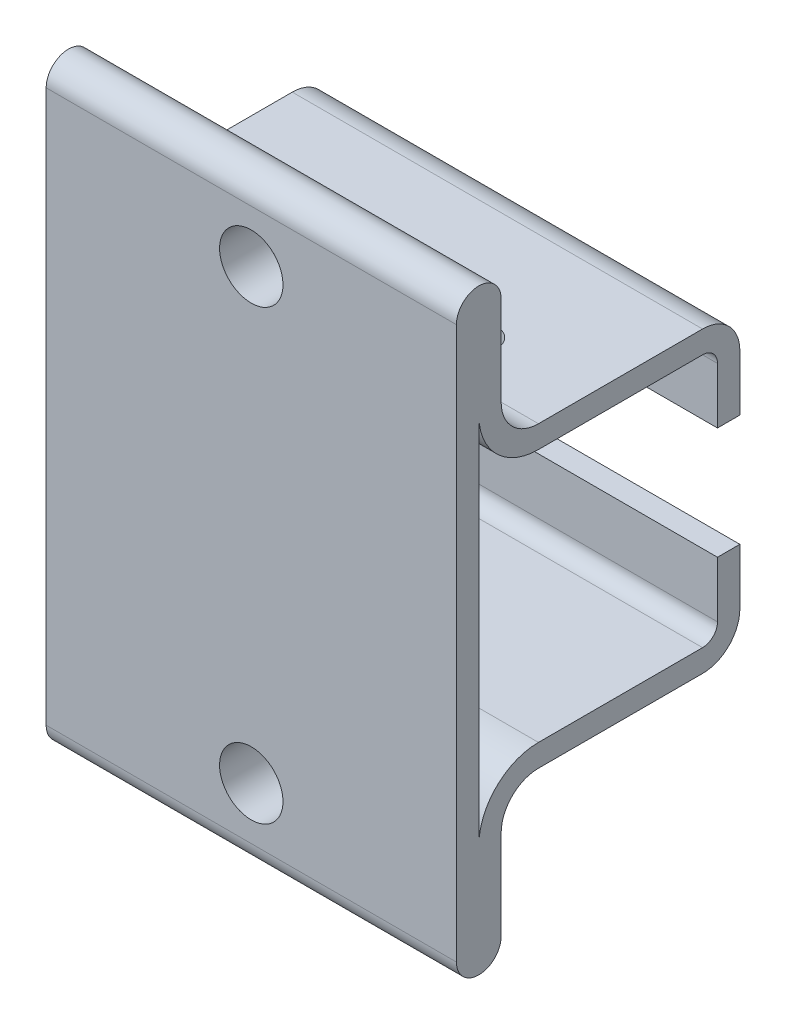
ISO-10303-21;
HEADER;
FILE_DESCRIPTION(('STEP AP214'),'2;1');
FILE_NAME('part.step','',(''),(''),'','','');
FILE_SCHEMA(('AUTOMOTIVE_DESIGN { 1 0 10303 214 1 1 1 1 }'));
ENDSEC;
DATA;
#1=APPLICATION_CONTEXT('core data for automotive mechanical design processes');
#2=APPLICATION_PROTOCOL_DEFINITION('international standard','automotive_design',2000,#1);
#3=PRODUCT_CONTEXT('',#1,'mechanical');
#4=PRODUCT('Part','Part','',(#3));
#5=PRODUCT_RELATED_PRODUCT_CATEGORY('part','',(#4));
#6=PRODUCT_DEFINITION_FORMATION('','',#4);
#7=PRODUCT_DEFINITION_CONTEXT('part definition',#1,'design');
#8=PRODUCT_DEFINITION('design','',#6,#7);
#9=PRODUCT_DEFINITION_SHAPE('','',#8);
#10=(LENGTH_UNIT() NAMED_UNIT(*) SI_UNIT(.MILLI.,.METRE.));
#11=(NAMED_UNIT(*) PLANE_ANGLE_UNIT() SI_UNIT($,.RADIAN.));
#12=(NAMED_UNIT(*) SI_UNIT($,.STERADIAN.) SOLID_ANGLE_UNIT());
#13=UNCERTAINTY_MEASURE_WITH_UNIT(LENGTH_MEASURE(1.E-05),#10,'distance_accuracy_value','');
#14=(GEOMETRIC_REPRESENTATION_CONTEXT(3) GLOBAL_UNCERTAINTY_ASSIGNED_CONTEXT((#13)) GLOBAL_UNIT_ASSIGNED_CONTEXT((#10,
#11,#12)) REPRESENTATION_CONTEXT('',''));
#15=CARTESIAN_POINT('',(0.,0.,0.));
#16=DIRECTION('',(0.,0.,1.));
#17=DIRECTION('',(1.,0.,0.));
#18=AXIS2_PLACEMENT_3D('',#15,#16,#17);
#19=CARTESIAN_POINT('',(-14.,12.4999750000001,20.9999240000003));
#20=DIRECTION('',(0.,-1.,0.));
#21=DIRECTION('',(1.,0.,0.));
#22=AXIS2_PLACEMENT_3D('',#19,#20,#21);
#23=CYLINDRICAL_SURFACE('',#22,2.46380000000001);
#24=CARTESIAN_POINT('',(-14.,12.499975,20.9999240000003));
#25=DIRECTION('',(0.,-1.,0.));
#26=DIRECTION('',(1.,0.,0.));
#27=AXIS2_PLACEMENT_3D('',#24,#25,#26);
#28=CIRCLE('',#27,2.46380000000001);
#29=CARTESIAN_POINT('',(-11.5362,12.499975,20.9999240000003));
#30=VERTEX_POINT('',#29);
#31=EDGE_CURVE('E33',#30,#30,#28,.T.);
#32=ORIENTED_EDGE('',*,*,#31,.F.);
#33=EDGE_LOOP('',(#32));
#34=FACE_BOUND('',#33,.T.);
#35=CARTESIAN_POINT('',(-14.,9.499981,20.9999240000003));
#36=DIRECTION('',(0.,-1.,0.));
#37=DIRECTION('',(1.,0.,0.));
#38=AXIS2_PLACEMENT_3D('',#35,#36,#37);
#39=CIRCLE('',#38,2.46380000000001);
#40=CARTESIAN_POINT('',(-16.4638,9.499981,20.9999240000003));
#41=VERTEX_POINT('',#40);
#42=EDGE_CURVE('E18',#41,#41,#39,.F.);
#43=ORIENTED_EDGE('',*,*,#42,.F.);
#44=EDGE_LOOP('',(#43));
#45=FACE_BOUND('',#44,.T.);
#46=ADVANCED_FACE('F15',(#34,#45),#23,.F.);
#47=CARTESIAN_POINT('',(-54.99989,0.,2.999994));
#48=DIRECTION('',(0.,0.,1.));
#49=DIRECTION('',(1.,0.,0.));
#50=AXIS2_PLACEMENT_3D('',#47,#48,#49);
#51=PLANE('',#50);
#52=DIRECTION('',(0.,1.,0.));
#53=VECTOR('',#52,1.);
#54=CARTESIAN_POINT('',(-54.99989,-7.499985,2.999994));
#55=LINE('',#54,#53);
#56=CARTESIAN_POINT('',(-54.99989,0.,2.999994));
#57=VERTEX_POINT('',#56);
#58=CARTESIAN_POINT('',(-54.99989,7.49998500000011,2.999994));
#59=VERTEX_POINT('',#58);
#60=EDGE_CURVE('E282',#57,#59,#55,.T.);
#61=ORIENTED_EDGE('',*,*,#60,.F.);
#62=DIRECTION('',(1.,0.,0.));
#63=VECTOR('',#62,1.);
#64=CARTESIAN_POINT('',(-54.99989,0.,2.999994));
#65=LINE('',#64,#63);
#66=CARTESIAN_POINT('',(0.,0.,2.999994));
#67=VERTEX_POINT('',#66);
#68=EDGE_CURVE('E215',#67,#57,#65,.F.);
#69=ORIENTED_EDGE('',*,*,#68,.F.);
#70=DIRECTION('',(0.,1.,0.));
#71=VECTOR('',#70,1.);
#72=CARTESIAN_POINT('',(0.,-7.499985,2.999994));
#73=LINE('',#72,#71);
#74=CARTESIAN_POINT('',(0.,7.49998500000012,2.999994));
#75=VERTEX_POINT('',#74);
#76=EDGE_CURVE('E219',#67,#75,#73,.T.);
#77=ORIENTED_EDGE('',*,*,#76,.T.);
#78=DIRECTION('',(1.,0.,0.));
#79=VECTOR('',#78,1.);
#80=CARTESIAN_POINT('',(-54.99989,7.49998499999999,2.999994));
#81=LINE('',#80,#79);
#82=EDGE_CURVE('E362',#75,#59,#81,.F.);
#83=ORIENTED_EDGE('',*,*,#82,.T.);
#84=EDGE_LOOP('',(#61,#69,#77,#83));
#85=FACE_BOUND('',#84,.T.);
#86=ADVANCED_FACE('F366',(#85),#51,.T.);
#87=CARTESIAN_POINT('',(-54.99989,7.49998500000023,4.99999));
#88=DIRECTION('',(1.,0.,0.));
#89=DIRECTION('',(0.,1.,0.));
#90=AXIS2_PLACEMENT_3D('',#87,#88,#89);
#91=CYLINDRICAL_SURFACE('',#90,1.999996);
#92=DIRECTION('',(1.,0.,0.));
#93=VECTOR('',#92,1.);
#94=CARTESIAN_POINT('',(-54.99989,9.499981,4.99999));
#95=LINE('',#94,#93);
#96=CARTESIAN_POINT('',(-54.99989,9.499981,4.99999));
#97=VERTEX_POINT('',#96);
#98=CARTESIAN_POINT('',(0.,9.49998100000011,4.99999));
#99=VERTEX_POINT('',#98);
#100=EDGE_CURVE('E361',#97,#99,#95,.T.);
#101=ORIENTED_EDGE('',*,*,#100,.F.);
#102=CARTESIAN_POINT('',(-54.99989,7.49998500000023,4.99999));
#103=DIRECTION('',(1.,0.,0.));
#104=DIRECTION('',(0.,1.,0.));
#105=AXIS2_PLACEMENT_3D('',#102,#103,#104);
#106=CIRCLE('',#105,1.999996);
#107=EDGE_CURVE('E279',#59,#97,#106,.T.);
#108=ORIENTED_EDGE('',*,*,#107,.F.);
#109=ORIENTED_EDGE('',*,*,#82,.F.);
#110=CARTESIAN_POINT('',(0.,7.49998500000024,4.99999));
#111=DIRECTION('',(1.,0.,0.));
#112=DIRECTION('',(0.,1.,0.));
#113=AXIS2_PLACEMENT_3D('',#110,#111,#112);
#114=CIRCLE('',#113,1.999996);
#115=EDGE_CURVE('E221',#75,#99,#114,.T.);
#116=ORIENTED_EDGE('',*,*,#115,.T.);
#117=EDGE_LOOP('',(#101,#108,#109,#116));
#118=FACE_BOUND('',#117,.T.);
#119=ADVANCED_FACE('F369',(#118),#91,.F.);
#120=CARTESIAN_POINT('',(-54.99989,9.499981,4.99999));
#121=DIRECTION('',(0.,-1.,0.));
#122=DIRECTION('',(0.,0.,-1.));
#123=AXIS2_PLACEMENT_3D('',#120,#121,#122);
#124=PLANE('',#123);
#125=ORIENTED_EDGE('',*,*,#42,.T.);
#126=EDGE_LOOP('',(#125));
#127=FACE_BOUND('',#126,.T.);
#128=DIRECTION('',(0.,0.,1.));
#129=VECTOR('',#128,1.);
#130=CARTESIAN_POINT('',(-54.99989,9.499981,24.8297080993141));
#131=LINE('',#130,#129);
#132=CARTESIAN_POINT('',(-54.99989,9.499981,26.999946));
#133=VERTEX_POINT('',#132);
#134=EDGE_CURVE('E278',#97,#133,#131,.T.);
#135=ORIENTED_EDGE('',*,*,#134,.F.);
#136=ORIENTED_EDGE('',*,*,#100,.T.);
#137=DIRECTION('',(0.,0.,1.));
#138=VECTOR('',#137,1.);
#139=CARTESIAN_POINT('',(0.,9.49998100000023,24.8297080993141));
#140=LINE('',#139,#138);
#141=CARTESIAN_POINT('',(0.,9.49998100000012,26.999946));
#142=VERTEX_POINT('',#141);
#143=EDGE_CURVE('E308',#99,#142,#140,.T.);
#144=ORIENTED_EDGE('',*,*,#143,.T.);
#145=DIRECTION('',(1.,0.,0.));
#146=VECTOR('',#145,1.);
#147=CARTESIAN_POINT('',(-54.99989,9.499981,26.999946));
#148=LINE('',#147,#146);
#149=EDGE_CURVE('E358',#133,#142,#148,.T.);
#150=ORIENTED_EDGE('',*,*,#149,.F.);
#151=EDGE_LOOP('',(#135,#136,#144,#150));
#152=FACE_BOUND('',#151,.T.);
#153=ADVANCED_FACE('F492',(#127,#152),#124,.T.);
#154=CARTESIAN_POINT('',(-54.99989,17.499965,26.999946));
#155=DIRECTION('',(1.,0.,0.));
#156=DIRECTION('',(0.,1.,0.));
#157=AXIS2_PLACEMENT_3D('',#154,#155,#156);
#158=CYLINDRICAL_SURFACE('',#157,7.999984);
#159=CARTESIAN_POINT('',(-54.99989,17.499965,26.999946));
#160=DIRECTION('',(1.,0.,0.));
#161=DIRECTION('',(0.,1.,0.));
#162=AXIS2_PLACEMENT_3D('',#159,#160,#161);
#163=CIRCLE('',#162,7.999984);
#164=CARTESIAN_POINT('',(-54.99989,17.499965,34.99993));
#165=VERTEX_POINT('',#164);
#166=EDGE_CURVE('E275',#133,#165,#163,.F.);
#167=ORIENTED_EDGE('',*,*,#166,.F.);
#168=ORIENTED_EDGE('',*,*,#149,.T.);
#169=CARTESIAN_POINT('',(0.,17.499965,26.999946));
#170=DIRECTION('',(1.,0.,0.));
#171=DIRECTION('',(0.,1.,0.));
#172=AXIS2_PLACEMENT_3D('',#169,#170,#171);
#173=CIRCLE('',#172,7.999984);
#174=CARTESIAN_POINT('',(0.,17.499965,34.99993));
#175=VERTEX_POINT('',#174);
#176=EDGE_CURVE('E307',#142,#175,#173,.F.);
#177=ORIENTED_EDGE('',*,*,#176,.T.);
#178=DIRECTION('',(-1.,0.,0.));
#179=VECTOR('',#178,1.);
#180=CARTESIAN_POINT('',(-54.99989,17.499965,34.99993));
#181=LINE('',#180,#179);
#182=EDGE_CURVE('E354',#165,#175,#181,.F.);
#183=ORIENTED_EDGE('',*,*,#182,.F.);
#184=EDGE_LOOP('',(#167,#168,#177,#183));
#185=FACE_BOUND('',#184,.T.);
#186=ADVANCED_FACE('F490',(#185),#158,.T.);
#187=CARTESIAN_POINT('',(-54.99989,17.499965,34.99993));
#188=DIRECTION('',(0.,0.,-1.));
#189=DIRECTION('',(-1.,0.,0.));
#190=AXIS2_PLACEMENT_3D('',#187,#188,#189);
#191=PLANE('',#190);
#192=DIRECTION('',(0.,1.,0.));
#193=VECTOR('',#192,1.);
#194=CARTESIAN_POINT('',(-54.99989,-7.499985,34.99993));
#195=LINE('',#194,#193);
#196=CARTESIAN_POINT('',(-54.99989,-32.4999349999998,34.99993));
#197=VERTEX_POINT('',#196);
#198=EDGE_CURVE('E274',#165,#197,#195,.F.);
#199=ORIENTED_EDGE('',*,*,#198,.F.);
#200=ORIENTED_EDGE('',*,*,#182,.T.);
#201=DIRECTION('',(0.,1.,0.));
#202=VECTOR('',#201,1.);
#203=CARTESIAN_POINT('',(0.,-7.499985,34.99993));
#204=LINE('',#203,#202);
#205=CARTESIAN_POINT('',(0.,-32.4999349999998,34.99993));
#206=VERTEX_POINT('',#205);
#207=EDGE_CURVE('E306',#175,#206,#204,.F.);
#208=ORIENTED_EDGE('',*,*,#207,.T.);
#209=DIRECTION('',(1.,0.,0.));
#210=VECTOR('',#209,1.);
#211=CARTESIAN_POINT('',(-54.99989,-32.4999349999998,34.99993));
#212=LINE('',#211,#210);
#213=EDGE_CURVE('E351',#197,#206,#212,.T.);
#214=ORIENTED_EDGE('',*,*,#213,.F.);
#215=EDGE_LOOP('',(#199,#200,#208,#214));
#216=FACE_BOUND('',#215,.T.);
#217=ADVANCED_FACE('F421',(#216),#191,.T.);
#218=CARTESIAN_POINT('',(-54.99989,-32.4999349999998,26.999946));
#219=DIRECTION('',(1.,0.,0.));
#220=DIRECTION('',(0.,1.,0.));
#221=AXIS2_PLACEMENT_3D('',#218,#219,#220);
#222=CYLINDRICAL_SURFACE('',#221,7.999984);
#223=CARTESIAN_POINT('',(-54.99989,-32.4999349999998,26.999946));
#224=DIRECTION('',(1.,0.,0.));
#225=DIRECTION('',(0.,1.,0.));
#226=AXIS2_PLACEMENT_3D('',#223,#224,#225);
#227=CIRCLE('',#226,7.999984);
#228=CARTESIAN_POINT('',(-54.99989,-24.4999509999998,26.999946));
#229=VERTEX_POINT('',#228);
#230=EDGE_CURVE('E271',#197,#229,#227,.F.);
#231=ORIENTED_EDGE('',*,*,#230,.F.);
#232=ORIENTED_EDGE('',*,*,#213,.T.);
#233=CARTESIAN_POINT('',(1.11022302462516E-13,-32.4999349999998,26.999946));
#234=DIRECTION('',(1.,0.,0.));
#235=DIRECTION('',(0.,1.,0.));
#236=AXIS2_PLACEMENT_3D('',#233,#234,#235);
#237=CIRCLE('',#236,7.999984);
#238=CARTESIAN_POINT('',(0.,-24.4999509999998,26.999946));
#239=VERTEX_POINT('',#238);
#240=EDGE_CURVE('E304',#206,#239,#237,.F.);
#241=ORIENTED_EDGE('',*,*,#240,.T.);
#242=DIRECTION('',(1.,0.,0.));
#243=VECTOR('',#242,1.);
#244=CARTESIAN_POINT('',(-54.99989,-24.4999509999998,26.999946));
#245=LINE('',#244,#243);
#246=EDGE_CURVE('E348',#229,#239,#245,.T.);
#247=ORIENTED_EDGE('',*,*,#246,.F.);
#248=EDGE_LOOP('',(#231,#232,#241,#247));
#249=FACE_BOUND('',#248,.T.);
#250=ADVANCED_FACE('F425',(#249),#222,.T.);
#251=CARTESIAN_POINT('',(-54.99989,-24.4999509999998,26.999946));
#252=DIRECTION('',(0.,1.,0.));
#253=DIRECTION('',(0.,0.,1.));
#254=AXIS2_PLACEMENT_3D('',#251,#252,#253);
#255=PLANE('',#254);
#256=DIRECTION('',(0.,0.,1.));
#257=VECTOR('',#256,1.);
#258=CARTESIAN_POINT('',(-54.99989,-24.4999509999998,24.8297080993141));
#259=LINE('',#258,#257);
#260=CARTESIAN_POINT('',(-54.99989,-24.4999509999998,4.99999));
#261=VERTEX_POINT('',#260);
#262=EDGE_CURVE('E270',#229,#261,#259,.F.);
#263=ORIENTED_EDGE('',*,*,#262,.F.);
#264=ORIENTED_EDGE('',*,*,#246,.T.);
#265=DIRECTION('',(0.,0.,1.));
#266=VECTOR('',#265,1.);
#267=CARTESIAN_POINT('',(0.,-24.4999509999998,24.8297080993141));
#268=LINE('',#267,#266);
#269=CARTESIAN_POINT('',(0.,-24.4999509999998,4.99999));
#270=VERTEX_POINT('',#269);
#271=EDGE_CURVE('E303',#239,#270,#268,.F.);
#272=ORIENTED_EDGE('',*,*,#271,.T.);
#273=DIRECTION('',(1.,0.,0.));
#274=VECTOR('',#273,1.);
#275=CARTESIAN_POINT('',(-54.99989,-24.4999509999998,4.99999));
#276=LINE('',#275,#274);
#277=EDGE_CURVE('E346',#270,#261,#276,.F.);
#278=ORIENTED_EDGE('',*,*,#277,.T.);
#279=EDGE_LOOP('',(#263,#264,#272,#278));
#280=FACE_BOUND('',#279,.T.);
#281=ADVANCED_FACE('F429',(#280),#255,.T.);
#282=CARTESIAN_POINT('',(-54.99989,-22.4999549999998,4.99999));
#283=DIRECTION('',(1.,0.,0.));
#284=DIRECTION('',(0.,1.,0.));
#285=AXIS2_PLACEMENT_3D('',#282,#283,#284);
#286=CYLINDRICAL_SURFACE('',#285,1.999996);
#287=DIRECTION('',(1.,0.,0.));
#288=VECTOR('',#287,1.);
#289=CARTESIAN_POINT('',(-54.99989,-22.499955,2.999994));
#290=LINE('',#289,#288);
#291=CARTESIAN_POINT('',(-54.99989,-22.4999549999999,2.999994));
#292=VERTEX_POINT('',#291);
#293=CARTESIAN_POINT('',(0.,-22.4999549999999,2.999994));
#294=VERTEX_POINT('',#293);
#295=EDGE_CURVE('E343',#292,#294,#290,.T.);
#296=ORIENTED_EDGE('',*,*,#295,.F.);
#297=CARTESIAN_POINT('',(-54.99989,-22.4999549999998,4.99999));
#298=DIRECTION('',(1.,0.,0.));
#299=DIRECTION('',(0.,1.,0.));
#300=AXIS2_PLACEMENT_3D('',#297,#298,#299);
#301=CIRCLE('',#300,1.999996);
#302=EDGE_CURVE('E266',#261,#292,#301,.T.);
#303=ORIENTED_EDGE('',*,*,#302,.F.);
#304=ORIENTED_EDGE('',*,*,#277,.F.);
#305=CARTESIAN_POINT('',(0.,-22.4999549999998,4.99999));
#306=DIRECTION('',(1.,0.,0.));
#307=DIRECTION('',(0.,1.,0.));
#308=AXIS2_PLACEMENT_3D('',#305,#306,#307);
#309=CIRCLE('',#308,1.999996);
#310=EDGE_CURVE('E301',#270,#294,#309,.T.);
#311=ORIENTED_EDGE('',*,*,#310,.T.);
#312=EDGE_LOOP('',(#296,#303,#304,#311));
#313=FACE_BOUND('',#312,.T.);
#314=ADVANCED_FACE('F434',(#313),#286,.F.);
#315=CARTESIAN_POINT('',(-54.99989,-22.499955,2.999994));
#316=DIRECTION('',(0.,0.,1.));
#317=DIRECTION('',(1.,0.,0.));
#318=AXIS2_PLACEMENT_3D('',#315,#316,#317);
#319=PLANE('',#318);
#320=DIRECTION('',(0.,1.,0.));
#321=VECTOR('',#320,1.);
#322=CARTESIAN_POINT('',(-54.99989,-7.499985,2.999994));
#323=LINE('',#322,#321);
#324=CARTESIAN_POINT('',(-54.99989,-14.99997,2.999994));
#325=VERTEX_POINT('',#324);
#326=EDGE_CURVE('E269',#292,#325,#323,.T.);
#327=ORIENTED_EDGE('',*,*,#326,.F.);
#328=ORIENTED_EDGE('',*,*,#295,.T.);
#329=DIRECTION('',(0.,1.,0.));
#330=VECTOR('',#329,1.);
#331=CARTESIAN_POINT('',(0.,-7.499985,2.999994));
#332=LINE('',#331,#330);
#333=CARTESIAN_POINT('',(0.,-14.99997,2.999994));
#334=VERTEX_POINT('',#333);
#335=EDGE_CURVE('E228',#294,#334,#332,.T.);
#336=ORIENTED_EDGE('',*,*,#335,.T.);
#337=DIRECTION('',(1.,0.,0.));
#338=VECTOR('',#337,1.);
#339=CARTESIAN_POINT('',(-54.99989,-14.99997,2.999994));
#340=LINE('',#339,#338);
#341=EDGE_CURVE('E337',#325,#334,#340,.T.);
#342=ORIENTED_EDGE('',*,*,#341,.F.);
#343=EDGE_LOOP('',(#327,#328,#336,#342));
#344=FACE_BOUND('',#343,.T.);
#345=ADVANCED_FACE('F438',(#344),#319,.T.);
#346=CARTESIAN_POINT('',(-54.99989,-14.99997,2.999994));
#347=DIRECTION('',(0.,1.,0.));
#348=DIRECTION('',(0.,0.,1.));
#349=AXIS2_PLACEMENT_3D('',#346,#347,#348);
#350=PLANE('',#349);
#351=DIRECTION('',(0.,0.,1.));
#352=VECTOR('',#351,1.);
#353=CARTESIAN_POINT('',(-54.99989,-14.99997,24.8297080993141));
#354=LINE('',#353,#352);
#355=CARTESIAN_POINT('',(-54.99989,-14.99997,0.));
#356=VERTEX_POINT('',#355);
#357=EDGE_CURVE('E338',#325,#356,#354,.F.);
#358=ORIENTED_EDGE('',*,*,#357,.F.);
#359=ORIENTED_EDGE('',*,*,#341,.T.);
#360=DIRECTION('',(0.,0.,1.));
#361=VECTOR('',#360,1.);
#362=CARTESIAN_POINT('',(0.,-14.99997,24.8297080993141));
#363=LINE('',#362,#361);
#364=CARTESIAN_POINT('',(0.,-14.99997,0.));
#365=VERTEX_POINT('',#364);
#366=EDGE_CURVE('E226',#334,#365,#363,.F.);
#367=ORIENTED_EDGE('',*,*,#366,.T.);
#368=DIRECTION('',(-1.,0.,0.));
#369=VECTOR('',#368,1.);
#370=CARTESIAN_POINT('',(-54.99989,-14.99997,0.));
#371=LINE('',#370,#369);
#372=EDGE_CURVE('E334',#356,#365,#371,.F.);
#373=ORIENTED_EDGE('',*,*,#372,.F.);
#374=EDGE_LOOP('',(#358,#359,#367,#373));
#375=FACE_BOUND('',#374,.T.);
#376=ADVANCED_FACE('F442',(#375),#350,.T.);
#377=CARTESIAN_POINT('',(-54.99989,-14.99997,0.));
#378=DIRECTION('',(0.,0.,-1.));
#379=DIRECTION('',(-1.,0.,0.));
#380=AXIS2_PLACEMENT_3D('',#377,#378,#379);
#381=PLANE('',#380);
#382=DIRECTION('',(0.,1.,0.));
#383=VECTOR('',#382,1.);
#384=CARTESIAN_POINT('',(-54.99989,-7.499985,0.));
#385=LINE('',#384,#383);
#386=CARTESIAN_POINT('',(-54.99989,-22.4999549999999,0.));
#387=VERTEX_POINT('',#386);
#388=EDGE_CURVE('E265',#356,#387,#385,.F.);
#389=ORIENTED_EDGE('',*,*,#388,.F.);
#390=ORIENTED_EDGE('',*,*,#372,.T.);
#391=DIRECTION('',(0.,1.,0.));
#392=VECTOR('',#391,1.);
#393=CARTESIAN_POINT('',(0.,-7.499985,0.));
#394=LINE('',#393,#392);
#395=CARTESIAN_POINT('',(0.,-22.4999549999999,0.));
#396=VERTEX_POINT('',#395);
#397=EDGE_CURVE('E227',#365,#396,#394,.F.);
#398=ORIENTED_EDGE('',*,*,#397,.T.);
#399=DIRECTION('',(1.,0.,0.));
#400=VECTOR('',#399,1.);
#401=CARTESIAN_POINT('',(-54.99989,-22.499955,0.));
#402=LINE('',#401,#400);
#403=EDGE_CURVE('E331',#387,#396,#402,.T.);
#404=ORIENTED_EDGE('',*,*,#403,.F.);
#405=EDGE_LOOP('',(#389,#390,#398,#404));
#406=FACE_BOUND('',#405,.T.);
#407=ADVANCED_FACE('F446',(#406),#381,.T.);
#408=CARTESIAN_POINT('',(-54.99989,-22.4999549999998,4.99999));
#409=DIRECTION('',(1.,0.,0.));
#410=DIRECTION('',(0.,1.,0.));
#411=AXIS2_PLACEMENT_3D('',#408,#409,#410);
#412=CYLINDRICAL_SURFACE('',#411,4.99999);
#413=CARTESIAN_POINT('',(-54.99989,-22.4999549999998,4.99999));
#414=DIRECTION('',(1.,0.,0.));
#415=DIRECTION('',(0.,1.,0.));
#416=AXIS2_PLACEMENT_3D('',#413,#414,#415);
#417=CIRCLE('',#416,4.99999);
#418=CARTESIAN_POINT('',(-54.99989,-27.499945,4.99999));
#419=VERTEX_POINT('',#418);
#420=EDGE_CURVE('E262',#387,#419,#417,.F.);
#421=ORIENTED_EDGE('',*,*,#420,.F.);
#422=ORIENTED_EDGE('',*,*,#403,.T.);
#423=CARTESIAN_POINT('',(0.,-22.4999549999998,4.99999));
#424=DIRECTION('',(1.,0.,0.));
#425=DIRECTION('',(0.,1.,0.));
#426=AXIS2_PLACEMENT_3D('',#423,#424,#425);
#427=CIRCLE('',#426,4.99999);
#428=CARTESIAN_POINT('',(0.,-27.499945,4.99999));
#429=VERTEX_POINT('',#428);
#430=EDGE_CURVE('E299',#396,#429,#427,.F.);
#431=ORIENTED_EDGE('',*,*,#430,.T.);
#432=DIRECTION('',(1.,0.,0.));
#433=VECTOR('',#432,1.);
#434=CARTESIAN_POINT('',(-54.99989,-27.499945,4.99999));
#435=LINE('',#434,#433);
#436=EDGE_CURVE('E320',#419,#429,#435,.T.);
#437=ORIENTED_EDGE('',*,*,#436,.F.);
#438=EDGE_LOOP('',(#421,#422,#431,#437));
#439=FACE_BOUND('',#438,.T.);
#440=ADVANCED_FACE('F450',(#439),#412,.T.);
#441=CARTESIAN_POINT('',(-54.99989,-27.499945,4.99999));
#442=DIRECTION('',(0.,-1.,0.));
#443=DIRECTION('',(0.,0.,-1.));
#444=AXIS2_PLACEMENT_3D('',#441,#442,#443);
#445=PLANE('',#444);
#446=DIRECTION('',(0.,0.,1.));
#447=VECTOR('',#446,1.);
#448=CARTESIAN_POINT('',(-54.99989,-27.499945,24.8297080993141));
#449=LINE('',#448,#447);
#450=CARTESIAN_POINT('',(-54.99989,-27.4999449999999,26.999946));
#451=VERTEX_POINT('',#450);
#452=EDGE_CURVE('E261',#419,#451,#449,.T.);
#453=ORIENTED_EDGE('',*,*,#452,.F.);
#454=ORIENTED_EDGE('',*,*,#436,.T.);
#455=DIRECTION('',(0.,0.,1.));
#456=VECTOR('',#455,1.);
#457=CARTESIAN_POINT('',(0.,-27.499945,24.8297080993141));
#458=LINE('',#457,#456);
#459=CARTESIAN_POINT('',(0.,-27.4999449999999,26.999946));
#460=VERTEX_POINT('',#459);
#461=EDGE_CURVE('E298',#429,#460,#458,.T.);
#462=ORIENTED_EDGE('',*,*,#461,.T.);
#463=DIRECTION('',(1.,0.,0.));
#464=VECTOR('',#463,1.);
#465=CARTESIAN_POINT('',(-54.99989,-27.4999449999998,26.999946));
#466=LINE('',#465,#464);
#467=EDGE_CURVE('E315',#460,#451,#466,.F.);
#468=ORIENTED_EDGE('',*,*,#467,.T.);
#469=EDGE_LOOP('',(#453,#454,#462,#468));
#470=FACE_BOUND('',#469,.T.);
#471=ADVANCED_FACE('F454',(#470),#445,.T.);
#472=CARTESIAN_POINT('',(-54.99989,-32.4999349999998,26.999946));
#473=DIRECTION('',(1.,0.,0.));
#474=DIRECTION('',(0.,1.,0.));
#475=AXIS2_PLACEMENT_3D('',#472,#473,#474);
#476=CYLINDRICAL_SURFACE('',#475,4.99999);
#477=DIRECTION('',(-1.,0.,0.));
#478=VECTOR('',#477,1.);
#479=CARTESIAN_POINT('',(-54.99989,-32.4999349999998,31.999936));
#480=LINE('',#479,#478);
#481=CARTESIAN_POINT('',(-54.99989,-32.4999349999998,31.999936));
#482=VERTEX_POINT('',#481);
#483=CARTESIAN_POINT('',(0.,-32.4999349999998,31.999936));
#484=VERTEX_POINT('',#483);
#485=EDGE_CURVE('E214',#482,#484,#480,.F.);
#486=ORIENTED_EDGE('',*,*,#485,.F.);
#487=CARTESIAN_POINT('',(-54.99989,-32.4999349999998,26.999946));
#488=DIRECTION('',(1.,0.,0.));
#489=DIRECTION('',(0.,1.,0.));
#490=AXIS2_PLACEMENT_3D('',#487,#488,#489);
#491=CIRCLE('',#490,4.99999);
#492=EDGE_CURVE('E258',#451,#482,#491,.T.);
#493=ORIENTED_EDGE('',*,*,#492,.F.);
#494=ORIENTED_EDGE('',*,*,#467,.F.);
#495=CARTESIAN_POINT('',(0.,-32.4999349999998,26.999946));
#496=DIRECTION('',(1.,0.,0.));
#497=DIRECTION('',(0.,1.,0.));
#498=AXIS2_PLACEMENT_3D('',#495,#496,#497);
#499=CIRCLE('',#498,4.99999);
#500=EDGE_CURVE('E295',#460,#484,#499,.T.);
#501=ORIENTED_EDGE('',*,*,#500,.T.);
#502=EDGE_LOOP('',(#486,#493,#494,#501));
#503=FACE_BOUND('',#502,.T.);
#504=ADVANCED_FACE('F460',(#503),#476,.F.);
#505=CARTESIAN_POINT('',(-54.99989,17.499965,26.999946));
#506=DIRECTION('',(1.,0.,0.));
#507=DIRECTION('',(0.,1.,0.));
#508=AXIS2_PLACEMENT_3D('',#505,#506,#507);
#509=CYLINDRICAL_SURFACE('',#508,4.99999);
#510=DIRECTION('',(1.,0.,0.));
#511=VECTOR('',#510,1.);
#512=CARTESIAN_POINT('',(-54.99989,12.499975,26.999946));
#513=LINE('',#512,#511);
#514=CARTESIAN_POINT('',(-54.99989,12.499975,26.999946));
#515=VERTEX_POINT('',#514);
#516=CARTESIAN_POINT('',(0.,12.499975,26.999946));
#517=VERTEX_POINT('',#516);
#518=EDGE_CURVE('E310',#515,#517,#513,.T.);
#519=ORIENTED_EDGE('',*,*,#518,.F.);
#520=CARTESIAN_POINT('',(-54.99989,17.499965,26.999946));
#521=DIRECTION('',(1.,0.,0.));
#522=DIRECTION('',(0.,1.,0.));
#523=AXIS2_PLACEMENT_3D('',#520,#521,#522);
#524=CIRCLE('',#523,4.99999);
#525=CARTESIAN_POINT('',(-54.99989,17.499965,31.999936));
#526=VERTEX_POINT('',#525);
#527=EDGE_CURVE('E250',#526,#515,#524,.T.);
#528=ORIENTED_EDGE('',*,*,#527,.F.);
#529=DIRECTION('',(-1.,0.,0.));
#530=VECTOR('',#529,1.);
#531=CARTESIAN_POINT('',(-54.99989,17.499965,31.999936));
#532=LINE('',#531,#530);
#533=CARTESIAN_POINT('',(0.,17.499965,31.999936));
#534=VERTEX_POINT('',#533);
#535=EDGE_CURVE('E323',#534,#526,#532,.T.);
#536=ORIENTED_EDGE('',*,*,#535,.F.);
#537=CARTESIAN_POINT('',(0.,17.499965,26.999946));
#538=DIRECTION('',(1.,0.,0.));
#539=DIRECTION('',(0.,1.,0.));
#540=AXIS2_PLACEMENT_3D('',#537,#538,#539);
#541=CIRCLE('',#540,4.99999);
#542=EDGE_CURVE('E291',#534,#517,#541,.T.);
#543=ORIENTED_EDGE('',*,*,#542,.T.);
#544=EDGE_LOOP('',(#519,#528,#536,#543));
#545=FACE_BOUND('',#544,.T.);
#546=ADVANCED_FACE('F481',(#545),#509,.F.);
#547=CARTESIAN_POINT('',(-54.99989,12.499975,26.999946));
#548=DIRECTION('',(0.,1.,0.));
#549=DIRECTION('',(0.,0.,1.));
#550=AXIS2_PLACEMENT_3D('',#547,#548,#549);
#551=PLANE('',#550);
#552=ORIENTED_EDGE('',*,*,#31,.T.);
#553=EDGE_LOOP('',(#552));
#554=FACE_BOUND('',#553,.T.);
#555=DIRECTION('',(0.,0.,1.));
#556=VECTOR('',#555,1.);
#557=CARTESIAN_POINT('',(-54.99989,12.499975,24.8297080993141));
#558=LINE('',#557,#556);
#559=CARTESIAN_POINT('',(-54.99989,12.4999750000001,4.99999));
#560=VERTEX_POINT('',#559);
#561=EDGE_CURVE('E249',#515,#560,#558,.F.);
#562=ORIENTED_EDGE('',*,*,#561,.F.);
#563=ORIENTED_EDGE('',*,*,#518,.T.);
#564=DIRECTION('',(0.,0.,1.));
#565=VECTOR('',#564,1.);
#566=CARTESIAN_POINT('',(0.,12.499975,24.8297080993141));
#567=LINE('',#566,#565);
#568=CARTESIAN_POINT('',(0.,12.4999750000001,4.99999));
#569=VERTEX_POINT('',#568);
#570=EDGE_CURVE('E290',#517,#569,#567,.F.);
#571=ORIENTED_EDGE('',*,*,#570,.T.);
#572=DIRECTION('',(1.,0.,0.));
#573=VECTOR('',#572,1.);
#574=CARTESIAN_POINT('',(-54.99989,12.4999750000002,4.99999));
#575=LINE('',#574,#573);
#576=EDGE_CURVE('E309',#560,#569,#575,.T.);
#577=ORIENTED_EDGE('',*,*,#576,.F.);
#578=EDGE_LOOP('',(#562,#563,#571,#577));
#579=FACE_BOUND('',#578,.T.);
#580=ADVANCED_FACE('F483',(#554,#579),#551,.T.);
#581=CARTESIAN_POINT('',(-54.99989,7.49998500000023,4.99999));
#582=DIRECTION('',(1.,0.,0.));
#583=DIRECTION('',(0.,1.,0.));
#584=AXIS2_PLACEMENT_3D('',#581,#582,#583);
#585=CYLINDRICAL_SURFACE('',#584,4.99999);
#586=CARTESIAN_POINT('',(-54.99989,7.49998500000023,4.99999));
#587=DIRECTION('',(1.,0.,0.));
#588=DIRECTION('',(0.,1.,0.));
#589=AXIS2_PLACEMENT_3D('',#586,#587,#588);
#590=CIRCLE('',#589,4.99999);
#591=CARTESIAN_POINT('',(-54.99989,7.49998500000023,0.));
#592=VERTEX_POINT('',#591);
#593=EDGE_CURVE('E245',#560,#592,#590,.F.);
#594=ORIENTED_EDGE('',*,*,#593,.F.);
#595=ORIENTED_EDGE('',*,*,#576,.T.);
#596=CARTESIAN_POINT('',(0.,7.49998500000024,4.99999));
#597=DIRECTION('',(1.,0.,0.));
#598=DIRECTION('',(0.,1.,0.));
#599=AXIS2_PLACEMENT_3D('',#596,#597,#598);
#600=CIRCLE('',#599,4.99999);
#601=CARTESIAN_POINT('',(0.,7.49998500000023,0.));
#602=VERTEX_POINT('',#601);
#603=EDGE_CURVE('E204',#569,#602,#600,.F.);
#604=ORIENTED_EDGE('',*,*,#603,.T.);
#605=DIRECTION('',(-1.,0.,0.));
#606=VECTOR('',#605,1.);
#607=CARTESIAN_POINT('',(-54.99989,7.49998500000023,0.));
#608=LINE('',#607,#606);
#609=EDGE_CURVE('E199',#592,#602,#608,.F.);
#610=ORIENTED_EDGE('',*,*,#609,.F.);
#611=EDGE_LOOP('',(#594,#595,#604,#610));
#612=FACE_BOUND('',#611,.T.);
#613=ADVANCED_FACE('F486',(#612),#585,.T.);
#614=CARTESIAN_POINT('',(-54.99989,7.49998500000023,0.));
#615=DIRECTION('',(0.,0.,-1.));
#616=DIRECTION('',(-1.,0.,0.));
#617=AXIS2_PLACEMENT_3D('',#614,#615,#616);
#618=PLANE('',#617);
#619=DIRECTION('',(0.,1.,0.));
#620=VECTOR('',#619,1.);
#621=CARTESIAN_POINT('',(-54.99989,-7.499985,0.));
#622=LINE('',#621,#620);
#623=CARTESIAN_POINT('',(-54.99989,0.,0.));
#624=VERTEX_POINT('',#623);
#625=EDGE_CURVE('E248',#592,#624,#622,.F.);
#626=ORIENTED_EDGE('',*,*,#625,.F.);
#627=ORIENTED_EDGE('',*,*,#609,.T.);
#628=DIRECTION('',(0.,1.,0.));
#629=VECTOR('',#628,1.);
#630=CARTESIAN_POINT('',(0.,-7.499985,0.));
#631=LINE('',#630,#629);
#632=CARTESIAN_POINT('',(0.,0.,0.));
#633=VERTEX_POINT('',#632);
#634=EDGE_CURVE('E193',#602,#633,#631,.F.);
#635=ORIENTED_EDGE('',*,*,#634,.T.);
#636=DIRECTION('',(1.,0.,0.));
#637=VECTOR('',#636,1.);
#638=CARTESIAN_POINT('',(-54.99989,0.,0.));
#639=LINE('',#638,#637);
#640=EDGE_CURVE('E197',#624,#633,#639,.T.);
#641=ORIENTED_EDGE('',*,*,#640,.F.);
#642=EDGE_LOOP('',(#626,#627,#635,#641));
#643=FACE_BOUND('',#642,.T.);
#644=ADVANCED_FACE('F196',(#643),#618,.T.);
#645=CARTESIAN_POINT('',(-54.99989,0.,0.));
#646=DIRECTION('',(0.,-1.,0.));
#647=DIRECTION('',(0.,0.,-1.));
#648=AXIS2_PLACEMENT_3D('',#645,#646,#647);
#649=PLANE('',#648);
#650=DIRECTION('',(0.,0.,1.));
#651=VECTOR('',#650,1.);
#652=CARTESIAN_POINT('',(-54.99989,0.,24.8297080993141));
#653=LINE('',#652,#651);
#654=EDGE_CURVE('E212',#624,#57,#653,.T.);
#655=ORIENTED_EDGE('',*,*,#654,.F.);
#656=ORIENTED_EDGE('',*,*,#640,.T.);
#657=DIRECTION('',(0.,0.,1.));
#658=VECTOR('',#657,1.);
#659=CARTESIAN_POINT('',(0.,0.,24.8297080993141));
#660=LINE('',#659,#658);
#661=EDGE_CURVE('E203',#633,#67,#660,.T.);
#662=ORIENTED_EDGE('',*,*,#661,.T.);
#663=ORIENTED_EDGE('',*,*,#68,.T.);
#664=EDGE_LOOP('',(#655,#656,#662,#663));
#665=FACE_BOUND('',#664,.T.);
#666=ADVANCED_FACE('F208',(#665),#649,.T.);
#667=CARTESIAN_POINT('',(-54.99989,-32.4999349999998,31.999936));
#668=DIRECTION('',(0.,0.,-1.));
#669=DIRECTION('',(-1.,0.,0.));
#670=AXIS2_PLACEMENT_3D('',#667,#668,#669);
#671=PLANE('',#670);
#672=CARTESIAN_POINT('',(-27.499945,-37.499925,31.999936));
#673=DIRECTION('',(0.,0.,1.));
#674=DIRECTION('',(1.,0.,0.));
#675=AXIS2_PLACEMENT_3D('',#672,#673,#674);
#676=CIRCLE('',#675,4.2499915);
#677=CARTESIAN_POINT('',(-27.499945,-41.7499165,31.999936));
#678=VERTEX_POINT('',#677);
#679=EDGE_CURVE('E236',#678,#678,#676,.T.);
#680=ORIENTED_EDGE('',*,*,#679,.T.);
#681=EDGE_LOOP('',(#680));
#682=FACE_BOUND('',#681,.T.);
#683=DIRECTION('',(0.,1.,0.));
#684=VECTOR('',#683,1.);
#685=CARTESIAN_POINT('',(-54.99989,-7.499985,31.999936));
#686=LINE('',#685,#684);
#687=CARTESIAN_POINT('',(-54.99989,-44.499911,31.999936));
#688=VERTEX_POINT('',#687);
#689=EDGE_CURVE('E257',#482,#688,#686,.F.);
#690=ORIENTED_EDGE('',*,*,#689,.F.);
#691=ORIENTED_EDGE('',*,*,#485,.T.);
#692=DIRECTION('',(0.,1.,0.));
#693=VECTOR('',#692,1.);
#694=CARTESIAN_POINT('',(0.,-7.499985,31.999936));
#695=LINE('',#694,#693);
#696=CARTESIAN_POINT('',(0.,-44.499911,31.999936));
#697=VERTEX_POINT('',#696);
#698=EDGE_CURVE('E297',#484,#697,#695,.F.);
#699=ORIENTED_EDGE('',*,*,#698,.T.);
#700=DIRECTION('',(1.,0.,0.));
#701=VECTOR('',#700,1.);
#702=CARTESIAN_POINT('',(-54.99989,-44.499911,31.999936));
#703=LINE('',#702,#701);
#704=EDGE_CURVE('E238',#688,#697,#703,.T.);
#705=ORIENTED_EDGE('',*,*,#704,.F.);
#706=EDGE_LOOP('',(#690,#691,#699,#705));
#707=FACE_BOUND('',#706,.T.);
#708=ADVANCED_FACE('F464',(#682,#707),#671,.T.);
#709=CARTESIAN_POINT('',(-54.99989,29.499941,31.999936));
#710=DIRECTION('',(0.,0.,-1.));
#711=DIRECTION('',(-1.,0.,0.));
#712=AXIS2_PLACEMENT_3D('',#709,#710,#711);
#713=PLANE('',#712);
#714=CARTESIAN_POINT('',(-27.499945,22.4999550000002,31.999936));
#715=DIRECTION('',(0.,0.,1.));
#716=DIRECTION('',(1.,0.,0.));
#717=AXIS2_PLACEMENT_3D('',#714,#715,#716);
#718=CIRCLE('',#717,4.2499915);
#719=CARTESIAN_POINT('',(-27.499945,18.2499635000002,31.999936));
#720=VERTEX_POINT('',#719);
#721=EDGE_CURVE('E233',#720,#720,#718,.T.);
#722=ORIENTED_EDGE('',*,*,#721,.T.);
#723=EDGE_LOOP('',(#722));
#724=FACE_BOUND('',#723,.T.);
#725=DIRECTION('',(0.,1.,0.));
#726=VECTOR('',#725,1.);
#727=CARTESIAN_POINT('',(-54.99989,-7.499985,31.999936));
#728=LINE('',#727,#726);
#729=CARTESIAN_POINT('',(-54.99989,29.499941,31.999936));
#730=VERTEX_POINT('',#729);
#731=EDGE_CURVE('E253',#730,#526,#728,.F.);
#732=ORIENTED_EDGE('',*,*,#731,.F.);
#733=DIRECTION('',(1.,0.,0.));
#734=VECTOR('',#733,1.);
#735=CARTESIAN_POINT('',(-54.99989,29.499941,31.999936));
#736=LINE('',#735,#734);
#737=CARTESIAN_POINT('',(0.,29.499941,31.999936));
#738=VERTEX_POINT('',#737);
#739=EDGE_CURVE('E286',#738,#730,#736,.F.);
#740=ORIENTED_EDGE('',*,*,#739,.F.);
#741=DIRECTION('',(0.,1.,0.));
#742=VECTOR('',#741,1.);
#743=CARTESIAN_POINT('',(0.,-7.499985,31.999936));
#744=LINE('',#743,#742);
#745=EDGE_CURVE('E294',#738,#534,#744,.F.);
#746=ORIENTED_EDGE('',*,*,#745,.T.);
#747=ORIENTED_EDGE('',*,*,#535,.T.);
#748=EDGE_LOOP('',(#732,#740,#746,#747));
#749=FACE_BOUND('',#748,.T.);
#750=ADVANCED_FACE('F478',(#724,#749),#713,.T.);
#751=CARTESIAN_POINT('',(0.,-7.499985,24.8297080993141));
#752=DIRECTION('',(-1.,0.,0.));
#753=DIRECTION('',(0.,0.,1.));
#754=AXIS2_PLACEMENT_3D('',#751,#752,#753);
#755=PLANE('',#754);
#756=ORIENTED_EDGE('',*,*,#76,.F.);
#757=ORIENTED_EDGE('',*,*,#661,.F.);
#758=ORIENTED_EDGE('',*,*,#634,.F.);
#759=ORIENTED_EDGE('',*,*,#603,.F.);
#760=ORIENTED_EDGE('',*,*,#570,.F.);
#761=ORIENTED_EDGE('',*,*,#542,.F.);
#762=ORIENTED_EDGE('',*,*,#745,.F.);
#763=CARTESIAN_POINT('',(0.,29.499941,34.99993));
#764=DIRECTION('',(1.,0.,0.));
#765=DIRECTION('',(0.,1.,0.));
#766=AXIS2_PLACEMENT_3D('',#763,#764,#765);
#767=CIRCLE('',#766,2.999994);
#768=CARTESIAN_POINT('',(0.,29.499941,37.999924));
#769=VERTEX_POINT('',#768);
#770=EDGE_CURVE('E283',#769,#738,#767,.F.);
#771=ORIENTED_EDGE('',*,*,#770,.F.);
#772=DIRECTION('',(0.,1.,0.));
#773=VECTOR('',#772,1.);
#774=CARTESIAN_POINT('',(0.,-44.4999109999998,37.999924));
#775=LINE('',#774,#773);
#776=CARTESIAN_POINT('',(0.,-44.4999109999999,37.999924));
#777=VERTEX_POINT('',#776);
#778=EDGE_CURVE('E235',#777,#769,#775,.T.);
#779=ORIENTED_EDGE('',*,*,#778,.F.);
#780=CARTESIAN_POINT('',(0.,-44.499911,34.99993));
#781=DIRECTION('',(1.,0.,0.));
#782=DIRECTION('',(0.,1.,0.));
#783=AXIS2_PLACEMENT_3D('',#780,#781,#782);
#784=CIRCLE('',#783,2.999994);
#785=EDGE_CURVE('E242',#697,#777,#784,.F.);
#786=ORIENTED_EDGE('',*,*,#785,.F.);
#787=ORIENTED_EDGE('',*,*,#698,.F.);
#788=ORIENTED_EDGE('',*,*,#500,.F.);
#789=ORIENTED_EDGE('',*,*,#461,.F.);
#790=ORIENTED_EDGE('',*,*,#430,.F.);
#791=ORIENTED_EDGE('',*,*,#397,.F.);
#792=ORIENTED_EDGE('',*,*,#366,.F.);
#793=ORIENTED_EDGE('',*,*,#335,.F.);
#794=ORIENTED_EDGE('',*,*,#310,.F.);
#795=ORIENTED_EDGE('',*,*,#271,.F.);
#796=ORIENTED_EDGE('',*,*,#240,.F.);
#797=ORIENTED_EDGE('',*,*,#207,.F.);
#798=ORIENTED_EDGE('',*,*,#176,.F.);
#799=ORIENTED_EDGE('',*,*,#143,.F.);
#800=ORIENTED_EDGE('',*,*,#115,.F.);
#801=EDGE_LOOP('',(#756,#757,#758,#759,#760,#761,#762,#771,#779,#786,#787,#788,#789,#790,#791,
#792,#793,#794,#795,#796,#797,#798,#799,#800));
#802=FACE_BOUND('',#801,.T.);
#803=ADVANCED_FACE('F217',(#802),#755,.F.);
#804=CARTESIAN_POINT('',(-54.99989,29.499941,34.99993));
#805=DIRECTION('',(1.,0.,0.));
#806=DIRECTION('',(0.,1.,0.));
#807=AXIS2_PLACEMENT_3D('',#804,#805,#806);
#808=CYLINDRICAL_SURFACE('',#807,2.999994);
#809=CARTESIAN_POINT('',(-54.99989,29.499941,34.99993));
#810=DIRECTION('',(1.,0.,0.));
#811=DIRECTION('',(0.,1.,0.));
#812=AXIS2_PLACEMENT_3D('',#809,#810,#811);
#813=CIRCLE('',#812,2.999994);
#814=CARTESIAN_POINT('',(-54.99989,29.499941,37.999924));
#815=VERTEX_POINT('',#814);
#816=EDGE_CURVE('E254',#815,#730,#813,.F.);
#817=ORIENTED_EDGE('',*,*,#816,.F.);
#818=DIRECTION('',(1.,0.,0.));
#819=VECTOR('',#818,1.);
#820=CARTESIAN_POINT('',(-54.99989,29.499941,37.999924));
#821=LINE('',#820,#819);
#822=EDGE_CURVE('E378',#769,#815,#821,.F.);
#823=ORIENTED_EDGE('',*,*,#822,.F.);
#824=ORIENTED_EDGE('',*,*,#770,.T.);
#825=ORIENTED_EDGE('',*,*,#739,.T.);
#826=EDGE_LOOP('',(#817,#823,#824,#825));
#827=FACE_BOUND('',#826,.T.);
#828=ADVANCED_FACE('F474',(#827),#808,.T.);
#829=CARTESIAN_POINT('',(-54.99989,-7.499985,24.8297080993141));
#830=DIRECTION('',(-1.,0.,0.));
#831=DIRECTION('',(0.,0.,1.));
#832=AXIS2_PLACEMENT_3D('',#829,#830,#831);
#833=PLANE('',#832);
#834=ORIENTED_EDGE('',*,*,#625,.T.);
#835=ORIENTED_EDGE('',*,*,#654,.T.);
#836=ORIENTED_EDGE('',*,*,#60,.T.);
#837=ORIENTED_EDGE('',*,*,#107,.T.);
#838=ORIENTED_EDGE('',*,*,#134,.T.);
#839=ORIENTED_EDGE('',*,*,#166,.T.);
#840=ORIENTED_EDGE('',*,*,#198,.T.);
#841=ORIENTED_EDGE('',*,*,#230,.T.);
#842=ORIENTED_EDGE('',*,*,#262,.T.);
#843=ORIENTED_EDGE('',*,*,#302,.T.);
#844=ORIENTED_EDGE('',*,*,#326,.T.);
#845=ORIENTED_EDGE('',*,*,#357,.T.);
#846=ORIENTED_EDGE('',*,*,#388,.T.);
#847=ORIENTED_EDGE('',*,*,#420,.T.);
#848=ORIENTED_EDGE('',*,*,#452,.T.);
#849=ORIENTED_EDGE('',*,*,#492,.T.);
#850=ORIENTED_EDGE('',*,*,#689,.T.);
#851=CARTESIAN_POINT('',(-54.99989,-44.499911,34.99993));
#852=DIRECTION('',(1.,0.,0.));
#853=DIRECTION('',(0.,1.,0.));
#854=AXIS2_PLACEMENT_3D('',#851,#852,#853);
#855=CIRCLE('',#854,2.999994);
#856=CARTESIAN_POINT('',(-54.99989,-44.4999109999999,37.999924));
#857=VERTEX_POINT('',#856);
#858=EDGE_CURVE('E239',#857,#688,#855,.T.);
#859=ORIENTED_EDGE('',*,*,#858,.F.);
#860=DIRECTION('',(0.,1.,0.));
#861=VECTOR('',#860,1.);
#862=CARTESIAN_POINT('',(-54.99989,-44.4999109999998,37.999924));
#863=LINE('',#862,#861);
#864=EDGE_CURVE('E381',#815,#857,#863,.F.);
#865=ORIENTED_EDGE('',*,*,#864,.F.);
#866=ORIENTED_EDGE('',*,*,#816,.T.);
#867=ORIENTED_EDGE('',*,*,#731,.T.);
#868=ORIENTED_EDGE('',*,*,#527,.T.);
#869=ORIENTED_EDGE('',*,*,#561,.T.);
#870=ORIENTED_EDGE('',*,*,#593,.T.);
#871=EDGE_LOOP('',(#834,#835,#836,#837,#838,#839,#840,#841,#842,#843,#844,#845,#846,#847,#848,
#849,#850,#859,#865,#866,#867,#868,#869,#870));
#872=FACE_BOUND('',#871,.T.);
#873=ADVANCED_FACE('F373',(#872),#833,.T.);
#874=CARTESIAN_POINT('',(-54.99989,-44.499911,34.99993));
#875=DIRECTION('',(1.,0.,0.));
#876=DIRECTION('',(0.,1.,0.));
#877=AXIS2_PLACEMENT_3D('',#874,#875,#876);
#878=CYLINDRICAL_SURFACE('',#877,2.999994);
#879=ORIENTED_EDGE('',*,*,#858,.T.);
#880=ORIENTED_EDGE('',*,*,#704,.T.);
#881=ORIENTED_EDGE('',*,*,#785,.T.);
#882=DIRECTION('',(1.,0.,0.));
#883=VECTOR('',#882,1.);
#884=CARTESIAN_POINT('',(-54.99989,-44.4999109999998,37.999924));
#885=LINE('',#884,#883);
#886=EDGE_CURVE('E232',#857,#777,#885,.T.);
#887=ORIENTED_EDGE('',*,*,#886,.F.);
#888=EDGE_LOOP('',(#879,#880,#881,#887));
#889=FACE_BOUND('',#888,.T.);
#890=ADVANCED_FACE('F468',(#889),#878,.T.);
#891=CARTESIAN_POINT('',(-27.499945,-37.499925,13.5185276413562));
#892=DIRECTION('',(0.,0.,1.));
#893=DIRECTION('',(1.,0.,0.));
#894=AXIS2_PLACEMENT_3D('',#891,#892,#893);
#895=CYLINDRICAL_SURFACE('',#894,4.2499915);
#896=CARTESIAN_POINT('',(-27.499945,-37.499925,37.999924));
#897=DIRECTION('',(0.,0.,1.));
#898=DIRECTION('',(1.,0.,0.));
#899=AXIS2_PLACEMENT_3D('',#896,#897,#898);
#900=CIRCLE('',#899,4.2499915);
#901=CARTESIAN_POINT('',(-27.499945,-41.7499165,37.999924));
#902=VERTEX_POINT('',#901);
#903=EDGE_CURVE('E23',#902,#902,#900,.F.);
#904=ORIENTED_EDGE('',*,*,#903,.F.);
#905=EDGE_LOOP('',(#904));
#906=FACE_BOUND('',#905,.T.);
#907=ORIENTED_EDGE('',*,*,#679,.F.);
#908=EDGE_LOOP('',(#907));
#909=FACE_BOUND('',#908,.T.);
#910=ADVANCED_FACE('F512',(#906,#909),#895,.F.);
#911=CARTESIAN_POINT('',(-27.499945,22.4999550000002,13.5185276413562));
#912=DIRECTION('',(0.,0.,1.));
#913=DIRECTION('',(1.,0.,0.));
#914=AXIS2_PLACEMENT_3D('',#911,#912,#913);
#915=CYLINDRICAL_SURFACE('',#914,4.2499915);
#916=ORIENTED_EDGE('',*,*,#721,.F.);
#917=EDGE_LOOP('',(#916));
#918=FACE_BOUND('',#917,.T.);
#919=CARTESIAN_POINT('',(-27.499945,22.4999550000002,37.999924));
#920=DIRECTION('',(0.,0.,1.));
#921=DIRECTION('',(1.,0.,0.));
#922=AXIS2_PLACEMENT_3D('',#919,#920,#921);
#923=CIRCLE('',#922,4.2499915);
#924=CARTESIAN_POINT('',(-27.499945,18.2499635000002,37.999924));
#925=VERTEX_POINT('',#924);
#926=EDGE_CURVE('E10',#925,#925,#923,.F.);
#927=ORIENTED_EDGE('',*,*,#926,.F.);
#928=EDGE_LOOP('',(#927));
#929=FACE_BOUND('',#928,.T.);
#930=ADVANCED_FACE('F505',(#918,#929),#915,.F.);
#931=CARTESIAN_POINT('',(-54.99989,-44.4999109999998,37.999924));
#932=DIRECTION('',(0.,0.,1.));
#933=DIRECTION('',(1.,0.,0.));
#934=AXIS2_PLACEMENT_3D('',#931,#932,#933);
#935=PLANE('',#934);
#936=ORIENTED_EDGE('',*,*,#926,.T.);
#937=EDGE_LOOP('',(#936));
#938=FACE_BOUND('',#937,.T.);
#939=ORIENTED_EDGE('',*,*,#903,.T.);
#940=EDGE_LOOP('',(#939));
#941=FACE_BOUND('',#940,.T.);
#942=ORIENTED_EDGE('',*,*,#864,.T.);
#943=ORIENTED_EDGE('',*,*,#886,.T.);
#944=ORIENTED_EDGE('',*,*,#778,.T.);
#945=ORIENTED_EDGE('',*,*,#822,.T.);
#946=EDGE_LOOP('',(#942,#943,#944,#945));
#947=FACE_BOUND('',#946,.T.);
#948=ADVANCED_FACE('F472',(#938,#941,#947),#935,.T.);
#949=CLOSED_SHELL('',(#46,#86,#119,#153,#186,#217,#250,#281,#314,#345,#376,#407,#440,#471,#504,
#546,#580,#613,#644,#666,#708,#750,#803,#828,#873,#890,#910,#930,#948));
#950=MANIFOLD_SOLID_BREP('B1',#949);
#951=ADVANCED_BREP_SHAPE_REPRESENTATION('',(#18,#950),#14);
#952=SHAPE_DEFINITION_REPRESENTATION(#9,#951);
ENDSEC;
END-ISO-10303-21;
